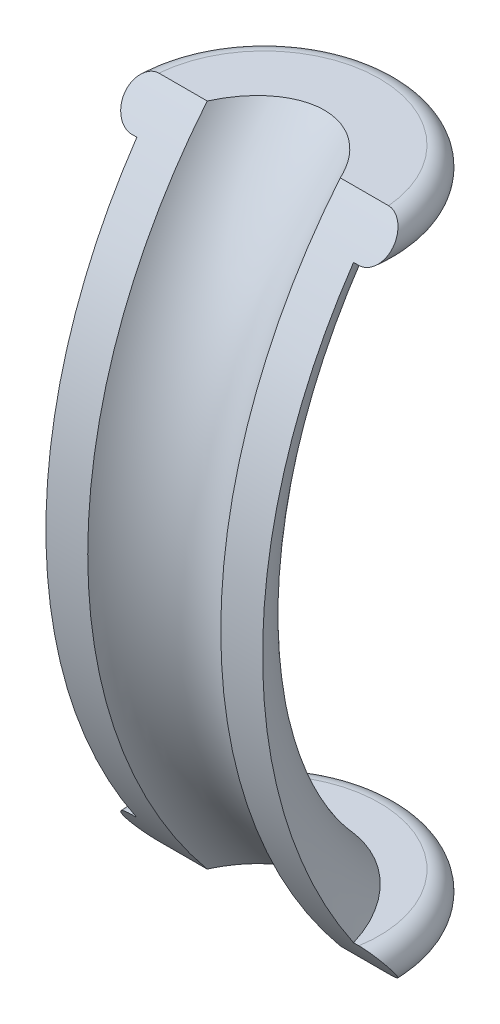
ISO-10303-21;
HEADER;
FILE_DESCRIPTION(('STEP AP214'),'2;1');
FILE_NAME('part.step','',(''),(''),'','','');
FILE_SCHEMA(('AUTOMOTIVE_DESIGN { 1 0 10303 214 1 1 1 1 }'));
ENDSEC;
DATA;
#1=APPLICATION_CONTEXT('core data for automotive mechanical design processes');
#2=APPLICATION_PROTOCOL_DEFINITION('international standard','automotive_design',2000,#1);
#3=PRODUCT_CONTEXT('',#1,'mechanical');
#4=PRODUCT('Part','Part','',(#3));
#5=PRODUCT_RELATED_PRODUCT_CATEGORY('part','',(#4));
#6=PRODUCT_DEFINITION_FORMATION('','',#4);
#7=PRODUCT_DEFINITION_CONTEXT('part definition',#1,'design');
#8=PRODUCT_DEFINITION('design','',#6,#7);
#9=PRODUCT_DEFINITION_SHAPE('','',#8);
#10=(LENGTH_UNIT() NAMED_UNIT(*) SI_UNIT(.MILLI.,.METRE.));
#11=(NAMED_UNIT(*) PLANE_ANGLE_UNIT() SI_UNIT($,.RADIAN.));
#12=(NAMED_UNIT(*) SI_UNIT($,.STERADIAN.) SOLID_ANGLE_UNIT());
#13=UNCERTAINTY_MEASURE_WITH_UNIT(LENGTH_MEASURE(1.E-05),#10,'distance_accuracy_value','');
#14=(GEOMETRIC_REPRESENTATION_CONTEXT(3) GLOBAL_UNCERTAINTY_ASSIGNED_CONTEXT((#13)) GLOBAL_UNIT_ASSIGNED_CONTEXT((#10,
#11,#12)) REPRESENTATION_CONTEXT('',''));
#15=CARTESIAN_POINT('',(0.,0.,0.));
#16=DIRECTION('',(0.,0.,1.));
#17=DIRECTION('',(1.,0.,0.));
#18=AXIS2_PLACEMENT_3D('',#15,#16,#17);
#19=CARTESIAN_POINT('',(0.,22.5,-133.));
#20=DIRECTION('',(1.,0.,0.));
#21=DIRECTION('',(0.,0.,-1.));
#22=AXIS2_PLACEMENT_3D('',#19,#20,#21);
#23=TOROIDAL_SURFACE('',#22,59.125,8.125);
#24=CARTESIAN_POINT('',(-6.99999999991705,22.5000000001,-133.0000000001));
#25=DIRECTION('',(1.,0.,0.));
#26=DIRECTION('',(0.,0.,-1.));
#27=AXIS2_PLACEMENT_3D('',#24,#25,#26);
#28=CIRCLE('',#27,55.);
#29=CARTESIAN_POINT('',(-6.99999999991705,-12.5,-90.5735931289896));
#30=VERTEX_POINT('',#29);
#31=CARTESIAN_POINT('',(-6.99999999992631,57.5000000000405,-90.5735931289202));
#32=VERTEX_POINT('',#31);
#33=EDGE_CURVE('E137',#30,#32,#28,.F.);
#34=ORIENTED_EDGE('',*,*,#33,.F.);
#35=CARTESIAN_POINT('',(0.,-12.5,-95.9055260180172));
#36=CARTESIAN_POINT('',(-0.0937331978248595,-12.5,-95.9055281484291));
#37=CARTESIAN_POINT('',(-0.187451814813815,-12.5,-95.9032952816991));
#38=CARTESIAN_POINT('',(-0.374672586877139,-12.5,-95.8943860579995));
#39=CARTESIAN_POINT('',(-0.46817475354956,-12.5,-95.8877099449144));
#40=CARTESIAN_POINT('',(-0.747888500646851,-12.5,-95.8610754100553));
#41=CARTESIAN_POINT('',(-0.933511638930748,-12.5,-95.8345106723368));
#42=CARTESIAN_POINT('',(-1.29984085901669,-12.5,-95.764673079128));
#43=CARTESIAN_POINT('',(-1.48057588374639,-12.5,-95.721549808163));
#44=CARTESIAN_POINT('',(-1.83754051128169,-12.5,-95.619483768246));
#45=CARTESIAN_POINT('',(-2.01376940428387,-12.5,-95.5605385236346));
#46=CARTESIAN_POINT('',(-2.36003599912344,-12.5,-95.428158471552));
#47=CARTESIAN_POINT('',(-2.53009158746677,-12.5,-95.3547702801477));
#48=CARTESIAN_POINT('',(-2.86373486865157,-12.5,-95.1946275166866));
#49=CARTESIAN_POINT('',(-3.02732277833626,-12.5,-95.1078733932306));
#50=CARTESIAN_POINT('',(-3.50815213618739,-12.5,-94.829018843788));
#51=CARTESIAN_POINT('',(-3.81484604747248,-12.5,-94.6185673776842));
#52=CARTESIAN_POINT('',(-4.51548035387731,-12.5,-94.0648010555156));
#53=CARTESIAN_POINT('',(-4.8942127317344,-12.5,-93.7022515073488));
#54=CARTESIAN_POINT('',(-5.41441773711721,-12.5,-93.1168288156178));
#55=CARTESIAN_POINT('',(-5.58000849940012,-12.5,-92.9144845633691));
#56=CARTESIAN_POINT('',(-5.89537787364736,-12.5,-92.4978329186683));
#57=CARTESIAN_POINT('',(-6.04516129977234,-12.5,-92.2835291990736));
#58=CARTESIAN_POINT('',(-6.34135226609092,-12.5,-91.8257293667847));
#59=CARTESIAN_POINT('',(-6.48633351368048,-12.5,-91.5813152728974));
#60=CARTESIAN_POINT('',(-6.7571571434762,-12.5,-91.0837714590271));
#61=CARTESIAN_POINT('',(-6.8830970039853,-12.5,-90.8306948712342));
#62=CARTESIAN_POINT('',(-6.99999999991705,-12.5,-90.5735931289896));
#63=B_SPLINE_CURVE_WITH_KNOTS('',3,(#35,#36,#37,#38,#39,#40,#41,#42,#43,#44,#45,#46,#47,#48,#49,
#50,#51,#52,#53,#54,#55,#56,#57,#58,#59,#60,#61,#62),.UNSPECIFIED.,.F.,.F.,(4,2,2,2,2,2,2,2,2,2,
2,2,2,4),(0.,0.281144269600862,0.562273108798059,1.12392034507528,1.68060886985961,
2.23738455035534,2.79239181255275,3.34738045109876,4.45931236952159,6.02320977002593,
6.80705887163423,7.59066855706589,8.44242246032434,9.289656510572),.UNSPECIFIED.);
#64=CARTESIAN_POINT('',(0.,-12.5,-95.9055260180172));
#65=VERTEX_POINT('',#64);
#66=EDGE_CURVE('E244',#65,#30,#63,.T.);
#67=ORIENTED_EDGE('',*,*,#66,.F.);
#68=CARTESIAN_POINT('',(6.99999999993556,-12.5,-90.5735931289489));
#69=CARTESIAN_POINT('',(6.92877591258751,-12.5,-90.7302670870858));
#70=CARTESIAN_POINT('',(6.8542047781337,-12.5,-90.8854008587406));
#71=CARTESIAN_POINT('',(6.69830519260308,-12.5,-91.1922641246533));
#72=CARTESIAN_POINT('',(6.61697567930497,-12.5,-91.343993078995));
#73=CARTESIAN_POINT('',(6.3623192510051,-12.5,-91.7943457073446));
#74=CARTESIAN_POINT('',(6.17871949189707,-12.5,-92.0872607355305));
#75=CARTESIAN_POINT('',(5.78174064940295,-12.5,-92.6571797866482));
#76=CARTESIAN_POINT('',(5.56804870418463,-12.5,-92.9339667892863));
#77=CARTESIAN_POINT('',(5.11266778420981,-12.5,-93.4628141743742));
#78=CARTESIAN_POINT('',(4.87102034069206,-12.5,-93.7149102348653));
#79=CARTESIAN_POINT('',(4.31336335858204,-12.5,-94.2317146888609));
#80=CARTESIAN_POINT('',(3.99179066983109,-12.5,-94.4905712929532));
#81=CARTESIAN_POINT('',(3.48260048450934,-12.5,-94.8377542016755));
#82=CARTESIAN_POINT('',(3.30868408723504,-12.5,-94.946496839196));
#83=CARTESIAN_POINT('',(2.95225178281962,-12.5,-95.1489286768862));
#84=CARTESIAN_POINT('',(2.76973743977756,-12.5,-95.2426206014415));
#85=CARTESIAN_POINT('',(2.4243964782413,-12.5,-95.4007062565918));
#86=CARTESIAN_POINT('',(2.2626117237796,-12.5,-95.4673818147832));
#87=CARTESIAN_POINT('',(1.93421327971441,-12.5,-95.5875097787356));
#88=CARTESIAN_POINT('',(1.76760053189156,-12.5,-95.6409647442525));
#89=CARTESIAN_POINT('',(1.43068821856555,-12.5,-95.7336901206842));
#90=CARTESIAN_POINT('',(1.26039345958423,-12.5,-95.7729779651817));
#91=CARTESIAN_POINT('',(0.917111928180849,-12.5,-95.8367100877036));
#92=CARTESIAN_POINT('',(0.744126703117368,-12.5,-95.8611625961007));
#93=CARTESIAN_POINT('',(0.475606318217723,-12.5,-95.8871399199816));
#94=CARTESIAN_POINT('',(0.380562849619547,-12.5,-95.8940338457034));
#95=CARTESIAN_POINT('',(0.190350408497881,-12.5,-95.9032260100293));
#96=CARTESIAN_POINT('',(0.0951816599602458,-12.5,-95.9055288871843));
#97=CARTESIAN_POINT('',(0.,-12.5,-95.9055260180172));
#98=B_SPLINE_CURVE_WITH_KNOTS('',3,(#68,#69,#70,#71,#72,#73,#74,#75,#76,#77,#78,#79,#80,#81,#82,
#83,#84,#85,#86,#87,#88,#89,#90,#91,#92,#93,#94,#95,#96,#97),.UNSPECIFIED.,.F.,.F.,(4,2,2,2,2,2,
2,2,2,2,2,2,2,2,4),(0.,0.516232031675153,1.0325453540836,2.06804018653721,3.11522800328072,
4.16087960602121,5.39413308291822,6.00888788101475,6.62353127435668,7.14796688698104,
7.67230087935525,8.19598742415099,8.71938317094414,9.0051638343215,9.29065561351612),.UNSPECIFIED.);
#99=CARTESIAN_POINT('',(6.99999999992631,-12.5000000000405,-90.5735931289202));
#100=VERTEX_POINT('',#99);
#101=EDGE_CURVE('E21',#100,#65,#98,.T.);
#102=ORIENTED_EDGE('',*,*,#101,.F.);
#103=CARTESIAN_POINT('',(6.99999999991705,22.4999999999,-133.0000000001));
#104=DIRECTION('',(-1.,0.,0.));
#105=DIRECTION('',(0.,0.,1.));
#106=AXIS2_PLACEMENT_3D('',#103,#104,#105);
#107=CIRCLE('',#106,55.);
#108=CARTESIAN_POINT('',(6.99999999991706,57.5,-90.5735931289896));
#109=VERTEX_POINT('',#108);
#110=EDGE_CURVE('E215',#109,#100,#107,.F.);
#111=ORIENTED_EDGE('',*,*,#110,.F.);
#112=CARTESIAN_POINT('',(0.,57.5,-95.9055260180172));
#113=CARTESIAN_POINT('',(0.0937331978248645,57.5,-95.9055281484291));
#114=CARTESIAN_POINT('',(0.187451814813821,57.5,-95.9032952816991));
#115=CARTESIAN_POINT('',(0.374672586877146,57.5,-95.8943860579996));
#116=CARTESIAN_POINT('',(0.468174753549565,57.5,-95.8877099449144));
#117=CARTESIAN_POINT('',(0.747888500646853,57.5,-95.8610754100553));
#118=CARTESIAN_POINT('',(0.933511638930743,57.5,-95.8345106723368));
#119=CARTESIAN_POINT('',(1.29984085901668,57.5,-95.764673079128));
#120=CARTESIAN_POINT('',(1.48057588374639,57.5,-95.721549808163));
#121=CARTESIAN_POINT('',(1.8375405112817,57.5,-95.619483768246));
#122=CARTESIAN_POINT('',(2.01376940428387,57.5,-95.5605385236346));
#123=CARTESIAN_POINT('',(2.36003599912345,57.5,-95.428158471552));
#124=CARTESIAN_POINT('',(2.53009158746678,57.5,-95.3547702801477));
#125=CARTESIAN_POINT('',(2.86373486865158,57.5,-95.1946275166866));
#126=CARTESIAN_POINT('',(3.02732277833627,57.5,-95.1078733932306));
#127=CARTESIAN_POINT('',(3.5081521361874,57.5,-94.829018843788));
#128=CARTESIAN_POINT('',(3.81484604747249,57.5,-94.6185673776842));
#129=CARTESIAN_POINT('',(4.51548035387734,57.5,-94.0648010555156));
#130=CARTESIAN_POINT('',(4.89421273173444,57.5,-93.7022515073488));
#131=CARTESIAN_POINT('',(5.41441773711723,57.5,-93.1168288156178));
#132=CARTESIAN_POINT('',(5.58000849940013,57.5,-92.9144845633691));
#133=CARTESIAN_POINT('',(5.89537787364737,57.5,-92.4978329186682));
#134=CARTESIAN_POINT('',(6.04516129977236,57.5,-92.2835291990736));
#135=CARTESIAN_POINT('',(6.34135226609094,57.5,-91.8257293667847));
#136=CARTESIAN_POINT('',(6.48633351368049,57.5,-91.5813152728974));
#137=CARTESIAN_POINT('',(6.75715714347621,57.5,-91.0837714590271));
#138=CARTESIAN_POINT('',(6.88309700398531,57.5,-90.8306948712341));
#139=CARTESIAN_POINT('',(6.99999999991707,57.5,-90.5735931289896));
#140=B_SPLINE_CURVE_WITH_KNOTS('',3,(#112,#113,#114,#115,#116,#117,#118,#119,#120,#121,#122,
#123,#124,#125,#126,#127,#128,#129,#130,#131,#132,#133,#134,#135,#136,#137,#138,#139),
.UNSPECIFIED.,.F.,.F.,(4,2,2,2,2,2,2,2,2,2,2,2,2,4),(0.,0.281144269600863,0.562273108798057,
1.12392034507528,1.68060886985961,2.23738455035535,2.79239181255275,3.34738045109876,
4.45931236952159,6.02320977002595,6.80705887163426,7.59066855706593,8.44242246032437,
9.28965651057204),.UNSPECIFIED.);
#141=CARTESIAN_POINT('',(0.,57.5,-95.9055260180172));
#142=VERTEX_POINT('',#141);
#143=EDGE_CURVE('E123',#142,#109,#140,.T.);
#144=ORIENTED_EDGE('',*,*,#143,.F.);
#145=CARTESIAN_POINT('',(-6.99999999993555,57.5,-90.5735931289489));
#146=CARTESIAN_POINT('',(-6.92877591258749,57.5,-90.7302670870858));
#147=CARTESIAN_POINT('',(-6.85420477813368,57.5,-90.8854008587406));
#148=CARTESIAN_POINT('',(-6.69830519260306,57.5,-91.1922641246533));
#149=CARTESIAN_POINT('',(-6.61697567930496,57.5,-91.3439930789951));
#150=CARTESIAN_POINT('',(-6.36231925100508,57.5,-91.7943457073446));
#151=CARTESIAN_POINT('',(-6.17871949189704,57.5,-92.0872607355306));
#152=CARTESIAN_POINT('',(-5.78174064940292,57.5,-92.6571797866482));
#153=CARTESIAN_POINT('',(-5.56804870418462,57.5,-92.9339667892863));
#154=CARTESIAN_POINT('',(-5.1126677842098,57.5,-93.4628141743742));
#155=CARTESIAN_POINT('',(-4.87102034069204,57.5,-93.7149102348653));
#156=CARTESIAN_POINT('',(-4.313363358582,57.5,-94.2317146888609));
#157=CARTESIAN_POINT('',(-3.99179066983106,57.5,-94.4905712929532));
#158=CARTESIAN_POINT('',(-3.4826004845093,57.5,-94.8377542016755));
#159=CARTESIAN_POINT('',(-3.30868408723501,57.5,-94.946496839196));
#160=CARTESIAN_POINT('',(-2.95225178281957,57.5,-95.1489286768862));
#161=CARTESIAN_POINT('',(-2.76973743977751,57.5,-95.2426206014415));
#162=CARTESIAN_POINT('',(-2.42439647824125,57.5,-95.4007062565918));
#163=CARTESIAN_POINT('',(-2.26261172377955,57.5,-95.4673818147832));
#164=CARTESIAN_POINT('',(-1.93421327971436,57.5,-95.5875097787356));
#165=CARTESIAN_POINT('',(-1.76760053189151,57.5,-95.6409647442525));
#166=CARTESIAN_POINT('',(-1.43068821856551,57.5,-95.7336901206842));
#167=CARTESIAN_POINT('',(-1.26039345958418,57.5,-95.7729779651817));
#168=CARTESIAN_POINT('',(-0.9171119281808,57.5,-95.8367100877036));
#169=CARTESIAN_POINT('',(-0.744126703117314,57.5,-95.8611625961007));
#170=CARTESIAN_POINT('',(-0.475606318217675,57.5,-95.8871399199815));
#171=CARTESIAN_POINT('',(-0.380562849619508,57.5,-95.8940338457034));
#172=CARTESIAN_POINT('',(-0.19035040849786,57.5,-95.9032260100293));
#173=CARTESIAN_POINT('',(-0.095181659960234,57.5,-95.9055288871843));
#174=CARTESIAN_POINT('',(0.,57.5,-95.9055260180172));
#175=B_SPLINE_CURVE_WITH_KNOTS('',3,(#145,#146,#147,#148,#149,#150,#151,#152,#153,#154,#155,
#156,#157,#158,#159,#160,#161,#162,#163,#164,#165,#166,#167,#168,#169,#170,#171,#172,#173,#174),
.UNSPECIFIED.,.F.,.F.,(4,2,2,2,2,2,2,2,2,2,2,2,2,2,4),(0.,0.516232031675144,1.0325453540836,
2.0680401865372,3.1152280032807,4.1608796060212,5.39413308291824,6.00888788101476,
6.62353127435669,7.14796688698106,7.67230087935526,8.19598742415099,8.71938317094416,
9.00516383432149,9.29065561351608),.UNSPECIFIED.);
#176=EDGE_CURVE('E358',#32,#142,#175,.T.);
#177=ORIENTED_EDGE('',*,*,#176,.F.);
#178=EDGE_LOOP('',(#34,#67,#102,#111,#144,#177));
#179=FACE_BOUND('',#178,.T.);
#180=ADVANCED_FACE('F16',(#179),#23,.F.);
#181=CARTESIAN_POINT('',(0.,-12.5,-98.));
#182=DIRECTION('',(0.,-1.,0.));
#183=DIRECTION('',(0.,0.,-1.));
#184=AXIS2_PLACEMENT_3D('',#181,#182,#183);
#185=PLANE('',#184);
#186=CARTESIAN_POINT('',(0.,-12.5,-89.55935832));
#187=DIRECTION('',(0.,1.,0.));
#188=DIRECTION('',(0.996495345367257,0.,-0.0836482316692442));
#189=AXIS2_PLACEMENT_3D('',#186,#187,#188);
#190=CIRCLE('',#189,12.125);
#191=CARTESIAN_POINT('',(12.082506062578,-12.5000000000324,-90.5735931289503));
#192=VERTEX_POINT('',#191);
#193=CARTESIAN_POINT('',(-12.082506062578,-12.5,-90.5735931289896));
#194=VERTEX_POINT('',#193);
#195=EDGE_CURVE('E99',#192,#194,#190,.T.);
#196=ORIENTED_EDGE('',*,*,#195,.F.);
#197=DIRECTION('',(-1.,0.,0.));
#198=VECTOR('',#197,1.);
#199=CARTESIAN_POINT('',(-15.,-12.500000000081,-90.5735931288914));
#200=LINE('',#199,#198);
#201=EDGE_CURVE('E328',#100,#192,#200,.F.);
#202=ORIENTED_EDGE('',*,*,#201,.F.);
#203=ORIENTED_EDGE('',*,*,#101,.T.);
#204=ORIENTED_EDGE('',*,*,#66,.T.);
#205=DIRECTION('',(1.,0.,0.));
#206=VECTOR('',#205,1.);
#207=CARTESIAN_POINT('',(15.,-12.5,-90.5735931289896));
#208=LINE('',#207,#206);
#209=EDGE_CURVE('E243',#194,#30,#208,.T.);
#210=ORIENTED_EDGE('',*,*,#209,.F.);
#211=EDGE_LOOP('',(#196,#202,#203,#204,#210));
#212=FACE_BOUND('',#211,.T.);
#213=ADVANCED_FACE('F209',(#212),#185,.T.);
#214=CARTESIAN_POINT('',(0.,55.5,-89.55935832));
#215=DIRECTION('',(0.,-1.,0.));
#216=DIRECTION('',(0.,0.,-1.));
#217=AXIS2_PLACEMENT_3D('',#214,#215,#216);
#218=TOROIDAL_SURFACE('',#217,12.125,2.);
#219=CARTESIAN_POINT('',(0.,53.5,-89.55935832));
#220=DIRECTION('',(0.,1.,0.));
#221=DIRECTION('',(0.986431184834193,0.,0.164175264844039));
#222=AXIS2_PLACEMENT_3D('',#219,#220,#221);
#223=CIRCLE('',#222,12.125);
#224=CARTESIAN_POINT('',(-11.9604781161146,53.5000000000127,-87.5687332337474));
#225=VERTEX_POINT('',#224);
#226=CARTESIAN_POINT('',(11.9604781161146,53.5,-87.568733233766));
#227=VERTEX_POINT('',#226);
#228=EDGE_CURVE('E229',#225,#227,#223,.F.);
#229=ORIENTED_EDGE('',*,*,#228,.F.);
#230=CARTESIAN_POINT('',(-14.1139201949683,55.5000000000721,-89.000000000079));
#231=CARTESIAN_POINT('',(-14.111891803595,55.4320309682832,-88.9490218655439));
#232=CARTESIAN_POINT('',(-14.1061423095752,55.3640496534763,-88.8982837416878));
#233=CARTESIAN_POINT('',(-14.0871716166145,55.2285028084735,-88.7975993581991));
#234=CARTESIAN_POINT('',(-14.0739473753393,55.1609374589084,-88.7476534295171));
#235=CARTESIAN_POINT('',(-14.0229345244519,54.9592510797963,-88.5992703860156));
#236=CARTESIAN_POINT('',(-13.9738162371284,54.8265082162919,-88.5025642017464));
#237=CARTESIAN_POINT('',(-13.8499093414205,54.5780368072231,-88.3231420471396));
#238=CARTESIAN_POINT('',(-13.7769239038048,54.4617633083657,-88.2399290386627));
#239=CARTESIAN_POINT('',(-13.605828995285,54.2417025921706,-88.0836056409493));
#240=CARTESIAN_POINT('',(-13.5077573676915,54.1378969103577,-88.0104802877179));
#241=CARTESIAN_POINT('',(-13.2980176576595,53.9564402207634,-87.8834448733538));
#242=CARTESIAN_POINT('',(-13.1883770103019,53.8772738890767,-87.8283959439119));
#243=CARTESIAN_POINT('',(-13.0114077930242,53.7729479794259,-87.7561658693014));
#244=CARTESIAN_POINT('',(-12.9503257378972,53.7405737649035,-87.7338111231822));
#245=CARTESIAN_POINT('',(-12.8244107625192,53.6811998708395,-87.6928916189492));
#246=CARTESIAN_POINT('',(-12.7595795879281,53.6541977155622,-87.674325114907));
#247=CARTESIAN_POINT('',(-12.5989507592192,53.5961403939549,-87.6344649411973));
#248=CARTESIAN_POINT('',(-12.5015152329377,53.5680918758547,-87.6152635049));
#249=CARTESIAN_POINT('',(-12.3025268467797,53.5257692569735,-87.5863201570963));
#250=CARTESIAN_POINT('',(-12.2009876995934,53.5114526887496,-87.5765490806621));
#251=CARTESIAN_POINT('',(-12.0758331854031,53.5030919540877,-87.5708432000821));
#252=CARTESIAN_POINT('',(-12.0527776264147,53.5019346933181,-87.5700534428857));
#253=CARTESIAN_POINT('',(-12.0066433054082,53.5003894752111,-87.5689989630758));
#254=CARTESIAN_POINT('',(-11.9835645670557,53.5000010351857,-87.5687339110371));
#255=CARTESIAN_POINT('',(-11.9604781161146,53.5,-87.5687332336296));
#256=B_SPLINE_CURVE_WITH_KNOTS('',3,(#230,#231,#232,#233,#234,#235,#236,#237,#238,#239,#240,
#241,#242,#243,#244,#245,#246,#247,#248,#249,#250,#251,#252,#253,#254,#255),.UNSPECIFIED.,.F.,
.F.,(4,2,2,2,2,2,2,2,2,2,2,2,4),(0.,0.254782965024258,0.509669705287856,1.02080567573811,
1.49988469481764,1.9782452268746,2.41340995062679,2.63104149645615,2.84857251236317,
3.15683016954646,3.46413140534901,3.53341430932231,3.60265370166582),.UNSPECIFIED.);
#257=CARTESIAN_POINT('',(-14.1139201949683,55.5000000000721,-89.000000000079));
#258=VERTEX_POINT('',#257);
#259=EDGE_CURVE('E131',#258,#225,#256,.T.);
#260=ORIENTED_EDGE('',*,*,#259,.F.);
#261=CARTESIAN_POINT('',(-12.082506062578,57.5,-90.5735931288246));
#262=CARTESIAN_POINT('',(-12.1316159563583,57.500009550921,-90.5736017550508));
#263=CARTESIAN_POINT('',(-12.1807117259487,57.4982041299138,-90.5721116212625));
#264=CARTESIAN_POINT('',(-12.2784368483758,57.4910950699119,-90.5662480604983));
#265=CARTESIAN_POINT('',(-12.3270665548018,57.4857943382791,-90.5618770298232));
#266=CARTESIAN_POINT('',(-12.4231747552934,57.4718737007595,-90.5504048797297));
#267=CARTESIAN_POINT('',(-12.4706588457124,57.4632767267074,-90.5433226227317));
#268=CARTESIAN_POINT('',(-12.5644824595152,57.442945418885,-90.5265878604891));
#269=CARTESIAN_POINT('',(-12.6108217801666,57.4312105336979,-90.5169349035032));
#270=CARTESIAN_POINT('',(-12.7473812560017,57.3916760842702,-90.4844486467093));
#271=CARTESIAN_POINT('',(-12.835534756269,57.3594875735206,-90.4580390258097));
#272=CARTESIAN_POINT('',(-13.0045747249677,57.2850709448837,-90.3971697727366));
#273=CARTESIAN_POINT('',(-13.0854479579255,57.2428250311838,-90.3626958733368));
#274=CARTESIAN_POINT('',(-13.2466136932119,57.1452199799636,-90.2833396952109));
#275=CARTESIAN_POINT('',(-13.3260170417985,57.0889658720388,-90.2377567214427));
#276=CARTESIAN_POINT('',(-13.4738800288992,56.9682098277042,-90.1403624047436));
#277=CARTESIAN_POINT('',(-13.5423384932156,56.9037070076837,-90.0885503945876));
#278=CARTESIAN_POINT('',(-13.6798782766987,56.7551640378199,-89.9698433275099));
#279=CARTESIAN_POINT('',(-13.7466080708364,56.6697400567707,-89.9019526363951));
#280=CARTESIAN_POINT('',(-13.8637093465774,56.4917718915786,-89.7614485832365));
#281=CARTESIAN_POINT('',(-13.914062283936,56.3992197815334,-89.6888299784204));
#282=CARTESIAN_POINT('',(-14.0047418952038,56.1941618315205,-89.5290571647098));
#283=CARTESIAN_POINT('',(-14.0422652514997,56.080800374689,-89.4414070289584));
#284=CARTESIAN_POINT('',(-14.0948297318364,55.8503084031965,-89.2646832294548));
#285=CARTESIAN_POINT('',(-14.1099059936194,55.7331840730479,-89.1756120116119));
#286=CARTESIAN_POINT('',(-14.1150118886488,55.5770839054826,-89.0578914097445));
#287=CARTESIAN_POINT('',(-14.1150681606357,55.5385419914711,-89.0289052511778));
#288=CARTESIAN_POINT('',(-14.1139201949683,55.5000000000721,-89.000000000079));
#289=B_SPLINE_CURVE_WITH_KNOTS('',3,(#261,#262,#263,#264,#265,#266,#267,#268,#269,#270,#271,
#272,#273,#274,#275,#276,#277,#278,#279,#280,#281,#282,#283,#284,#285,#286,#287,#288),
.UNSPECIFIED.,.F.,.F.,(4,2,2,2,2,2,2,2,2,2,2,2,2,4),(0.,0.147252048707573,0.294381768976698,
0.440505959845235,0.586655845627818,0.87777299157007,1.16940912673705,1.49059538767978,
1.81181608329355,2.19404994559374,2.57671513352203,3.01928152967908,3.46115441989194,
3.60576443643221),.UNSPECIFIED.);
#290=CARTESIAN_POINT('',(-12.082506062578,57.5000000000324,-90.5735931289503));
#291=VERTEX_POINT('',#290);
#292=EDGE_CURVE('E127',#291,#258,#289,.T.);
#293=ORIENTED_EDGE('',*,*,#292,.F.);
#294=CARTESIAN_POINT('',(0.,57.5,-89.55935832));
#295=DIRECTION('',(0.,-1.,0.));
#296=DIRECTION('',(-0.996495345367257,0.,-0.0836482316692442));
#297=AXIS2_PLACEMENT_3D('',#294,#295,#296);
#298=CIRCLE('',#297,12.125);
#299=CARTESIAN_POINT('',(12.082506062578,57.5,-90.5735931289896));
#300=VERTEX_POINT('',#299);
#301=EDGE_CURVE('E109',#300,#291,#298,.F.);
#302=ORIENTED_EDGE('',*,*,#301,.F.);
#303=CARTESIAN_POINT('',(14.1139201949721,55.5,-89.000000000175));
#304=CARTESIAN_POINT('',(14.1179863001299,55.6357106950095,-89.1017381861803));
#305=CARTESIAN_POINT('',(14.1070939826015,55.771288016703,-89.2044453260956));
#306=CARTESIAN_POINT('',(14.0555147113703,56.0386432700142,-89.4088676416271));
#307=CARTESIAN_POINT('',(14.0146616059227,56.1703957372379,-89.5105740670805));
#308=CARTESIAN_POINT('',(13.9061487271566,56.4183160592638,-89.7036778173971));
#309=CARTESIAN_POINT('',(13.839998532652,56.5349383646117,-89.7953361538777));
#310=CARTESIAN_POINT('',(13.6815327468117,56.7557596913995,-89.9702127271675));
#311=CARTESIAN_POINT('',(13.5892934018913,56.8599936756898,-90.0534546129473));
#312=CARTESIAN_POINT('',(13.4082133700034,57.025194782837,-90.1862290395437));
#313=CARTESIAN_POINT('',(13.3252578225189,57.090223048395,-90.2387755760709));
#314=CARTESIAN_POINT('',(13.1467868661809,57.2087696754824,-90.3349427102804));
#315=CARTESIAN_POINT('',(13.0512808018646,57.2622965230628,-90.378569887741));
#316=CARTESIAN_POINT('',(12.8657347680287,57.3475163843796,-90.4482299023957));
#317=CARTESIAN_POINT('',(12.7773149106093,57.3813415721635,-90.4759679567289));
#318=CARTESIAN_POINT('',(12.5945206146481,57.4371336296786,-90.5217937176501));
#319=CARTESIAN_POINT('',(12.5001602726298,57.4591274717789,-90.5399033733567));
#320=CARTESIAN_POINT('',(12.3512306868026,57.4828503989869,-90.5594498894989));
#321=CARTESIAN_POINT('',(12.2978585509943,57.4892448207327,-90.5647222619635));
#322=CARTESIAN_POINT('',(12.1905076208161,57.4978254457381,-90.5717991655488));
#323=CARTESIAN_POINT('',(12.1365283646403,57.5000081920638,-90.5736008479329));
#324=CARTESIAN_POINT('',(12.082506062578,57.5,-90.5735931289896));
#325=B_SPLINE_CURVE_WITH_KNOTS('',3,(#303,#304,#305,#306,#307,#308,#309,#310,#311,#312,#313,
#314,#315,#316,#317,#318,#319,#320,#321,#322,#323,#324),.UNSPECIFIED.,.F.,.F.,(4,2,2,2,2,2,2,2,
2,2,4),(0.,0.508545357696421,1.01993245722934,1.50464238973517,1.98795012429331,
2.33994972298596,2.69168870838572,2.98645759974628,3.28055161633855,3.4423350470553,
3.60425121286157),.UNSPECIFIED.);
#326=CARTESIAN_POINT('',(14.1139201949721,55.5,-89.000000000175));
#327=VERTEX_POINT('',#326);
#328=EDGE_CURVE('E340',#327,#300,#325,.T.);
#329=ORIENTED_EDGE('',*,*,#328,.F.);
#330=CARTESIAN_POINT('',(11.9604781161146,53.5,-87.568733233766));
#331=CARTESIAN_POINT('',(12.0136786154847,53.4999922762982,-87.5687287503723));
#332=CARTESIAN_POINT('',(12.066861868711,53.5020651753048,-87.5701424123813));
#333=CARTESIAN_POINT('',(12.1727392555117,53.5102014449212,-87.5756953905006));
#334=CARTESIAN_POINT('',(12.2254337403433,53.5162616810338,-87.5798325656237));
#335=CARTESIAN_POINT('',(12.3296624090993,53.5321564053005,-87.5906908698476));
#336=CARTESIAN_POINT('',(12.3812015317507,53.541968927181,-87.597396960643));
#337=CARTESIAN_POINT('',(12.4830805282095,53.565158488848,-87.6132604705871));
#338=CARTESIAN_POINT('',(12.5334201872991,53.5785361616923,-87.6224183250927));
#339=CARTESIAN_POINT('',(12.6818615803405,53.6235995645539,-87.6533035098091));
#340=CARTESIAN_POINT('',(12.7777896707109,53.6602798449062,-87.6784861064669));
#341=CARTESIAN_POINT('',(12.9618320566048,53.7451192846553,-87.7369337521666));
#342=CARTESIAN_POINT('',(13.0499341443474,53.7932959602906,-87.7702111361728));
#343=CARTESIAN_POINT('',(13.2252930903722,53.9045870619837,-87.847403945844));
#344=CARTESIAN_POINT('',(13.3115856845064,53.9687131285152,-87.8920501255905));
#345=CARTESIAN_POINT('',(13.4718233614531,54.1063131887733,-87.9883568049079));
#346=CARTESIAN_POINT('',(13.5457677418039,54.1797877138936,-88.0400177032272));
#347=CARTESIAN_POINT('',(13.6903512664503,54.3452060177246,-88.1570015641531));
#348=CARTESIAN_POINT('',(13.7589691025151,54.438284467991,-88.223220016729));
#349=CARTESIAN_POINT('',(13.8784729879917,54.6313152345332,-88.3615329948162));
#350=CARTESIAN_POINT('',(13.9293394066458,54.7312750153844,-88.4336339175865));
#351=CARTESIAN_POINT('',(14.0153685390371,54.9415178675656,-88.5864250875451));
#352=CARTESIAN_POINT('',(14.0494346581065,55.052062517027,-88.6673710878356));
#353=CARTESIAN_POINT('',(14.0970352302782,55.2751430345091,-88.8320288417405));
#354=CARTESIAN_POINT('',(14.1106111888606,55.3876744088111,-88.915734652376));
#355=CARTESIAN_POINT('',(14.1139201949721,55.5,-89.000000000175));
#356=B_SPLINE_CURVE_WITH_KNOTS('',3,(#330,#331,#332,#333,#334,#335,#336,#337,#338,#339,#340,
#341,#342,#343,#344,#345,#346,#347,#348,#349,#350,#351,#352,#353,#354,#355),.UNSPECIFIED.,.F.,
.F.,(4,2,2,2,2,2,2,2,2,2,2,2,4),(0.,0.159516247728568,0.318907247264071,0.477379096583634,
0.635879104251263,0.951660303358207,1.26792574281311,1.61579580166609,1.96368564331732,
2.36184168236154,2.76043664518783,3.18242025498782,3.60354792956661),.UNSPECIFIED.);
#357=EDGE_CURVE('E335',#227,#327,#356,.T.);
#358=ORIENTED_EDGE('',*,*,#357,.F.);
#359=EDGE_LOOP('',(#229,#260,#293,#302,#329,#358));
#360=FACE_BOUND('',#359,.T.);
#361=ADVANCED_FACE('F129',(#360),#218,.T.);
#362=CARTESIAN_POINT('',(0.,57.5,-98.));
#363=DIRECTION('',(0.,1.,0.));
#364=DIRECTION('',(0.,0.,1.));
#365=AXIS2_PLACEMENT_3D('',#362,#363,#364);
#366=PLANE('',#365);
#367=ORIENTED_EDGE('',*,*,#301,.T.);
#368=DIRECTION('',(1.,0.,0.));
#369=VECTOR('',#368,1.);
#370=CARTESIAN_POINT('',(15.,57.500000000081,-90.5735931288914));
#371=LINE('',#370,#369);
#372=EDGE_CURVE('E115',#32,#291,#371,.F.);
#373=ORIENTED_EDGE('',*,*,#372,.F.);
#374=ORIENTED_EDGE('',*,*,#176,.T.);
#375=ORIENTED_EDGE('',*,*,#143,.T.);
#376=DIRECTION('',(-1.,0.,0.));
#377=VECTOR('',#376,1.);
#378=CARTESIAN_POINT('',(-15.,57.5,-90.5735931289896));
#379=LINE('',#378,#377);
#380=EDGE_CURVE('E119',#300,#109,#379,.T.);
#381=ORIENTED_EDGE('',*,*,#380,.F.);
#382=EDGE_LOOP('',(#367,#373,#374,#375,#381));
#383=FACE_BOUND('',#382,.T.);
#384=ADVANCED_FACE('F112',(#383),#366,.T.);
#385=CARTESIAN_POINT('',(0.,-10.5,-89.55935832));
#386=DIRECTION('',(0.,1.,0.));
#387=DIRECTION('',(0.,0.,1.));
#388=AXIS2_PLACEMENT_3D('',#385,#386,#387);
#389=TOROIDAL_SURFACE('',#388,12.125,2.);
#390=CARTESIAN_POINT('',(0.,-8.5,-89.55935832));
#391=DIRECTION('',(0.,-1.,0.));
#392=DIRECTION('',(-0.986431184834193,0.,0.164175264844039));
#393=AXIS2_PLACEMENT_3D('',#390,#391,#392);
#394=CIRCLE('',#393,12.125);
#395=CARTESIAN_POINT('',(11.9604781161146,-8.50000000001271,-87.5687332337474));
#396=VERTEX_POINT('',#395);
#397=CARTESIAN_POINT('',(-11.9604781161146,-8.49999999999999,-87.568733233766));
#398=VERTEX_POINT('',#397);
#399=EDGE_CURVE('E251',#396,#398,#394,.F.);
#400=ORIENTED_EDGE('',*,*,#399,.F.);
#401=CARTESIAN_POINT('',(14.1139201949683,-10.5000000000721,-89.0000000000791));
#402=CARTESIAN_POINT('',(14.111891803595,-10.4320309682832,-88.949021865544));
#403=CARTESIAN_POINT('',(14.1061423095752,-10.3640496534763,-88.8982837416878));
#404=CARTESIAN_POINT('',(14.0871716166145,-10.2285028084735,-88.7975993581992));
#405=CARTESIAN_POINT('',(14.0739473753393,-10.1609374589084,-88.7476534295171));
#406=CARTESIAN_POINT('',(14.0229345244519,-9.95925107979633,-88.5992703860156));
#407=CARTESIAN_POINT('',(13.9738162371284,-9.82650821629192,-88.5025642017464));
#408=CARTESIAN_POINT('',(13.8499093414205,-9.57803680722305,-88.3231420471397));
#409=CARTESIAN_POINT('',(13.7769239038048,-9.46176330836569,-88.2399290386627));
#410=CARTESIAN_POINT('',(13.605828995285,-9.24170259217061,-88.0836056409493));
#411=CARTESIAN_POINT('',(13.5077573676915,-9.13789691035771,-88.0104802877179));
#412=CARTESIAN_POINT('',(13.2980176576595,-8.95644022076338,-87.8834448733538));
#413=CARTESIAN_POINT('',(13.1883770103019,-8.87727388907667,-87.8283959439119));
#414=CARTESIAN_POINT('',(13.0114077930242,-8.77294797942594,-87.7561658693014));
#415=CARTESIAN_POINT('',(12.9503257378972,-8.74057376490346,-87.7338111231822));
#416=CARTESIAN_POINT('',(12.8244107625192,-8.68119987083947,-87.6928916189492));
#417=CARTESIAN_POINT('',(12.7595795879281,-8.65419771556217,-87.674325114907));
#418=CARTESIAN_POINT('',(12.5989507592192,-8.59614039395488,-87.6344649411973));
#419=CARTESIAN_POINT('',(12.5015152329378,-8.56809187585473,-87.6152635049));
#420=CARTESIAN_POINT('',(12.3025268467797,-8.52576925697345,-87.5863201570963));
#421=CARTESIAN_POINT('',(12.2009876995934,-8.51145268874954,-87.5765490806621));
#422=CARTESIAN_POINT('',(12.0758331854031,-8.50309195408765,-87.5708432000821));
#423=CARTESIAN_POINT('',(12.0527776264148,-8.50193469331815,-87.5700534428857));
#424=CARTESIAN_POINT('',(12.0066433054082,-8.50038947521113,-87.5689989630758));
#425=CARTESIAN_POINT('',(11.9835645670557,-8.50000103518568,-87.5687339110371));
#426=CARTESIAN_POINT('',(11.9604781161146,-8.5,-87.5687332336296));
#427=B_SPLINE_CURVE_WITH_KNOTS('',3,(#401,#402,#403,#404,#405,#406,#407,#408,#409,#410,#411,
#412,#413,#414,#415,#416,#417,#418,#419,#420,#421,#422,#423,#424,#425,#426),.UNSPECIFIED.,.F.,
.F.,(4,2,2,2,2,2,2,2,2,2,2,2,4),(0.,0.254782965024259,0.509669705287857,1.0208056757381,
1.49988469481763,1.97824522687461,2.4134099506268,2.63104149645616,2.84857251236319,
3.15683016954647,3.46413140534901,3.53341430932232,3.60265370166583),.UNSPECIFIED.);
#428=CARTESIAN_POINT('',(14.1139201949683,-10.5000000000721,-89.0000000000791));
#429=VERTEX_POINT('',#428);
#430=EDGE_CURVE('E336',#429,#396,#427,.T.);
#431=ORIENTED_EDGE('',*,*,#430,.F.);
#432=CARTESIAN_POINT('',(12.082506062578,-12.5,-90.5735931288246));
#433=CARTESIAN_POINT('',(12.1316159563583,-12.500009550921,-90.5736017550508));
#434=CARTESIAN_POINT('',(12.1807117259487,-12.4982041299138,-90.5721116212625));
#435=CARTESIAN_POINT('',(12.2784368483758,-12.4910950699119,-90.5662480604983));
#436=CARTESIAN_POINT('',(12.3270665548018,-12.4857943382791,-90.5618770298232));
#437=CARTESIAN_POINT('',(12.4231747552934,-12.4718737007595,-90.5504048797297));
#438=CARTESIAN_POINT('',(12.4706588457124,-12.4632767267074,-90.5433226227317));
#439=CARTESIAN_POINT('',(12.5644824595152,-12.442945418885,-90.526587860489));
#440=CARTESIAN_POINT('',(12.6108217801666,-12.4312105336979,-90.5169349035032));
#441=CARTESIAN_POINT('',(12.7473812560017,-12.3916760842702,-90.4844486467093));
#442=CARTESIAN_POINT('',(12.835534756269,-12.3594875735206,-90.4580390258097));
#443=CARTESIAN_POINT('',(13.0045747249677,-12.2850709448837,-90.3971697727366));
#444=CARTESIAN_POINT('',(13.0854479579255,-12.2428250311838,-90.3626958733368));
#445=CARTESIAN_POINT('',(13.2466136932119,-12.1452199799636,-90.2833396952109));
#446=CARTESIAN_POINT('',(13.3260170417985,-12.0889658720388,-90.2377567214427));
#447=CARTESIAN_POINT('',(13.4738800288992,-11.9682098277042,-90.1403624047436));
#448=CARTESIAN_POINT('',(13.5423384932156,-11.9037070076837,-90.0885503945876));
#449=CARTESIAN_POINT('',(13.6798782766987,-11.7551640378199,-89.9698433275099));
#450=CARTESIAN_POINT('',(13.7466080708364,-11.6697400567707,-89.9019526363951));
#451=CARTESIAN_POINT('',(13.8637093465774,-11.4917718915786,-89.7614485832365));
#452=CARTESIAN_POINT('',(13.914062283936,-11.3992197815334,-89.6888299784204));
#453=CARTESIAN_POINT('',(14.0047418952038,-11.1941618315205,-89.5290571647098));
#454=CARTESIAN_POINT('',(14.0422652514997,-11.080800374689,-89.4414070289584));
#455=CARTESIAN_POINT('',(14.0948297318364,-10.8503084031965,-89.2646832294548));
#456=CARTESIAN_POINT('',(14.1099059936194,-10.7331840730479,-89.1756120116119));
#457=CARTESIAN_POINT('',(14.1150118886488,-10.5770839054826,-89.0578914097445));
#458=CARTESIAN_POINT('',(14.1150681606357,-10.5385419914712,-89.0289052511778));
#459=CARTESIAN_POINT('',(14.1139201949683,-10.5000000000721,-89.000000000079));
#460=B_SPLINE_CURVE_WITH_KNOTS('',3,(#432,#433,#434,#435,#436,#437,#438,#439,#440,#441,#442,
#443,#444,#445,#446,#447,#448,#449,#450,#451,#452,#453,#454,#455,#456,#457,#458,#459),
.UNSPECIFIED.,.F.,.F.,(4,2,2,2,2,2,2,2,2,2,2,2,2,4),(0.,0.147252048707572,0.294381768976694,
0.440505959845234,0.586655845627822,0.87777299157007,1.16940912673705,1.49059538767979,
1.81181608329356,2.19404994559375,2.57671513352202,3.01928152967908,3.46115441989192,
3.6057644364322),.UNSPECIFIED.);
#461=EDGE_CURVE('E240',#192,#429,#460,.T.);
#462=ORIENTED_EDGE('',*,*,#461,.F.);
#463=ORIENTED_EDGE('',*,*,#195,.T.);
#464=CARTESIAN_POINT('',(-14.1139201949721,-10.5,-89.000000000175));
#465=CARTESIAN_POINT('',(-14.1179863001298,-10.6357106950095,-89.1017381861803));
#466=CARTESIAN_POINT('',(-14.1070939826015,-10.771288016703,-89.2044453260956));
#467=CARTESIAN_POINT('',(-14.0555147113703,-11.0386432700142,-89.4088676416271));
#468=CARTESIAN_POINT('',(-14.0146616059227,-11.1703957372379,-89.5105740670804));
#469=CARTESIAN_POINT('',(-13.9061487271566,-11.4183160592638,-89.7036778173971));
#470=CARTESIAN_POINT('',(-13.839998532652,-11.5349383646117,-89.7953361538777));
#471=CARTESIAN_POINT('',(-13.6815327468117,-11.7557596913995,-89.9702127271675));
#472=CARTESIAN_POINT('',(-13.5892934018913,-11.8599936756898,-90.0534546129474));
#473=CARTESIAN_POINT('',(-13.4082133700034,-12.0251947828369,-90.1862290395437));
#474=CARTESIAN_POINT('',(-13.3252578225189,-12.090223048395,-90.2387755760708));
#475=CARTESIAN_POINT('',(-13.1467868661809,-12.2087696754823,-90.3349427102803));
#476=CARTESIAN_POINT('',(-13.0512808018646,-12.2622965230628,-90.378569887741));
#477=CARTESIAN_POINT('',(-12.8657347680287,-12.3475163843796,-90.4482299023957));
#478=CARTESIAN_POINT('',(-12.7773149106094,-12.3813415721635,-90.4759679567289));
#479=CARTESIAN_POINT('',(-12.5945206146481,-12.4371336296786,-90.5217937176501));
#480=CARTESIAN_POINT('',(-12.5001602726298,-12.4591274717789,-90.5399033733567));
#481=CARTESIAN_POINT('',(-12.3512306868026,-12.4828503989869,-90.5594498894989));
#482=CARTESIAN_POINT('',(-12.2978585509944,-12.4892448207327,-90.5647222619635));
#483=CARTESIAN_POINT('',(-12.1905076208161,-12.4978254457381,-90.5717991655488));
#484=CARTESIAN_POINT('',(-12.1365283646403,-12.5000081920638,-90.5736008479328));
#485=CARTESIAN_POINT('',(-12.082506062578,-12.5,-90.5735931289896));
#486=B_SPLINE_CURVE_WITH_KNOTS('',3,(#464,#465,#466,#467,#468,#469,#470,#471,#472,#473,#474,
#475,#476,#477,#478,#479,#480,#481,#482,#483,#484,#485),.UNSPECIFIED.,.F.,.F.,(4,2,2,2,2,2,2,2,
2,2,4),(0.,0.508545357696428,1.01993245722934,1.50464238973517,1.9879501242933,2.33994972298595,
2.69168870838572,2.98645759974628,3.28055161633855,3.44233504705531,3.60425121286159),.UNSPECIFIED.);
#487=CARTESIAN_POINT('',(-14.1139201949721,-10.5,-89.000000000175));
#488=VERTEX_POINT('',#487);
#489=EDGE_CURVE('E192',#488,#194,#486,.T.);
#490=ORIENTED_EDGE('',*,*,#489,.F.);
#491=CARTESIAN_POINT('',(-11.9604781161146,-8.5,-87.568733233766));
#492=CARTESIAN_POINT('',(-12.0136786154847,-8.49999227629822,-87.5687287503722));
#493=CARTESIAN_POINT('',(-12.066861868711,-8.50206517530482,-87.5701424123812));
#494=CARTESIAN_POINT('',(-12.1727392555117,-8.51020144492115,-87.5756953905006));
#495=CARTESIAN_POINT('',(-12.2254337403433,-8.51626168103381,-87.5798325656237));
#496=CARTESIAN_POINT('',(-12.3296624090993,-8.53215640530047,-87.5906908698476));
#497=CARTESIAN_POINT('',(-12.3812015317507,-8.54196892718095,-87.5973969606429));
#498=CARTESIAN_POINT('',(-12.4830805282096,-8.56515848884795,-87.613260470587));
#499=CARTESIAN_POINT('',(-12.5334201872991,-8.57853616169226,-87.6224183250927));
#500=CARTESIAN_POINT('',(-12.6818615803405,-8.62359956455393,-87.6533035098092));
#501=CARTESIAN_POINT('',(-12.7777896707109,-8.66027984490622,-87.6784861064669));
#502=CARTESIAN_POINT('',(-12.9618320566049,-8.74511928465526,-87.7369337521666));
#503=CARTESIAN_POINT('',(-13.0499341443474,-8.79329596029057,-87.7702111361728));
#504=CARTESIAN_POINT('',(-13.2252930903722,-8.90458706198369,-87.847403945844));
#505=CARTESIAN_POINT('',(-13.3115856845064,-8.96871312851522,-87.8920501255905));
#506=CARTESIAN_POINT('',(-13.4718233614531,-9.10631318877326,-87.9883568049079));
#507=CARTESIAN_POINT('',(-13.5457677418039,-9.17978771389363,-88.0400177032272));
#508=CARTESIAN_POINT('',(-13.6903512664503,-9.34520601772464,-88.1570015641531));
#509=CARTESIAN_POINT('',(-13.7589691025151,-9.43828446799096,-88.223220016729));
#510=CARTESIAN_POINT('',(-13.8784729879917,-9.63131523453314,-88.3615329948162));
#511=CARTESIAN_POINT('',(-13.9293394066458,-9.73127501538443,-88.4336339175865));
#512=CARTESIAN_POINT('',(-14.0153685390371,-9.94151786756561,-88.586425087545));
#513=CARTESIAN_POINT('',(-14.0494346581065,-10.0520625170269,-88.6673710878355));
#514=CARTESIAN_POINT('',(-14.0970352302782,-10.2751430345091,-88.8320288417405));
#515=CARTESIAN_POINT('',(-14.1106111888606,-10.3876744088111,-88.915734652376));
#516=CARTESIAN_POINT('',(-14.1139201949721,-10.5,-89.000000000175));
#517=B_SPLINE_CURVE_WITH_KNOTS('',3,(#491,#492,#493,#494,#495,#496,#497,#498,#499,#500,#501,
#502,#503,#504,#505,#506,#507,#508,#509,#510,#511,#512,#513,#514,#515,#516),.UNSPECIFIED.,.F.,
.F.,(4,2,2,2,2,2,2,2,2,2,2,2,4),(0.,0.159516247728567,0.31890724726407,0.477379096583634,
0.635879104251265,0.951660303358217,1.26792574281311,1.61579580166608,1.96368564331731,
2.36184168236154,2.76043664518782,3.18242025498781,3.60354792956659),.UNSPECIFIED.);
#518=EDGE_CURVE('E193',#398,#488,#517,.T.);
#519=ORIENTED_EDGE('',*,*,#518,.F.);
#520=EDGE_LOOP('',(#400,#431,#462,#463,#490,#519));
#521=FACE_BOUND('',#520,.T.);
#522=ADVANCED_FACE('F150',(#521),#389,.T.);
#523=CARTESIAN_POINT('',(15.,22.5000000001,-133.0000000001));
#524=DIRECTION('',(1.,0.,0.));
#525=DIRECTION('',(0.,0.,-1.));
#526=AXIS2_PLACEMENT_3D('',#523,#524,#525);
#527=CYLINDRICAL_SURFACE('',#526,55.);
#528=ORIENTED_EDGE('',*,*,#489,.T.);
#529=ORIENTED_EDGE('',*,*,#209,.T.);
#530=ORIENTED_EDGE('',*,*,#33,.T.);
#531=ORIENTED_EDGE('',*,*,#372,.T.);
#532=ORIENTED_EDGE('',*,*,#292,.T.);
#533=ORIENTED_EDGE('',*,*,#259,.T.);
#534=DIRECTION('',(1.,0.,0.));
#535=VECTOR('',#534,1.);
#536=CARTESIAN_POINT('',(0.,53.5,-87.5687332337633));
#537=LINE('',#536,#535);
#538=CARTESIAN_POINT('',(-11.401754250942,53.5,-87.5687332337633));
#539=VERTEX_POINT('',#538);
#540=EDGE_CURVE('E245',#539,#225,#537,.F.);
#541=ORIENTED_EDGE('',*,*,#540,.F.);
#542=CARTESIAN_POINT('',(-11.4017542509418,22.5,-133.));
#543=DIRECTION('',(1.,0.,0.));
#544=DIRECTION('',(0.,0.,-1.));
#545=AXIS2_PLACEMENT_3D('',#542,#543,#544);
#546=CIRCLE('',#545,54.9999999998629);
#547=CARTESIAN_POINT('',(-11.401754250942,-8.5,-87.5687332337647));
#548=VERTEX_POINT('',#547);
#549=EDGE_CURVE('E257',#548,#539,#546,.F.);
#550=ORIENTED_EDGE('',*,*,#549,.F.);
#551=DIRECTION('',(1.,0.,0.));
#552=VECTOR('',#551,1.);
#553=CARTESIAN_POINT('',(0.,-8.5,-87.568733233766));
#554=LINE('',#553,#552);
#555=EDGE_CURVE('E249',#398,#548,#554,.T.);
#556=ORIENTED_EDGE('',*,*,#555,.F.);
#557=ORIENTED_EDGE('',*,*,#518,.T.);
#558=EDGE_LOOP('',(#528,#529,#530,#531,#532,#533,#541,#550,#556,#557));
#559=FACE_BOUND('',#558,.T.);
#560=ADVANCED_FACE('F135',(#559),#527,.T.);
#561=CARTESIAN_POINT('',(0.,53.5,-89.55935832));
#562=DIRECTION('',(0.,-1.,0.));
#563=DIRECTION('',(0.,0.,-1.));
#564=AXIS2_PLACEMENT_3D('',#561,#562,#563);
#565=PLANE('',#564);
#566=CARTESIAN_POINT('',(0.,53.5,-97.6729565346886));
#567=CARTESIAN_POINT('',(0.143311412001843,53.5,-97.6729597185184));
#568=CARTESIAN_POINT('',(0.286600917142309,53.5,-97.6695751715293));
#569=CARTESIAN_POINT('',(0.572854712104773,53.5,-97.6560701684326));
#570=CARTESIAN_POINT('',(0.715819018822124,53.5,-97.6459500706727));
#571=CARTESIAN_POINT('',(1.14352463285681,53.5,-97.6055735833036));
#572=CARTESIAN_POINT('',(1.42738146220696,53.5,-97.5653008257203));
#573=CARTESIAN_POINT('',(1.98781257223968,53.5,-97.4593787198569));
#574=CARTESIAN_POINT('',(2.26442770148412,53.5,-97.3939423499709));
#575=CARTESIAN_POINT('',(2.81086622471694,53.5,-97.2390187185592));
#576=CARTESIAN_POINT('',(3.08068857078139,53.5,-97.1495277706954));
#577=CARTESIAN_POINT('',(3.61101927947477,53.5,-96.9484617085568));
#578=CARTESIAN_POINT('',(3.87155316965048,53.5,-96.8369536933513));
#579=CARTESIAN_POINT('',(4.38282323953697,53.5,-96.5935273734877));
#580=CARTESIAN_POINT('',(4.63355977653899,53.5,-96.4616098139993));
#581=CARTESIAN_POINT('',(5.37051953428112,53.5,-96.0374771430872));
#582=CARTESIAN_POINT('',(5.84073312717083,53.5,-95.7171780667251));
#583=CARTESIAN_POINT('',(6.90164594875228,53.5,-94.8837069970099));
#584=CARTESIAN_POINT('',(7.47099024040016,53.5,-94.3433347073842));
#585=CARTESIAN_POINT('',(8.25338807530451,53.5,-93.4694193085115));
#586=CARTESIAN_POINT('',(8.50261580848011,53.5,-93.1669823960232));
#587=CARTESIAN_POINT('',(8.97699208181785,53.5,-92.5436839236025));
#588=CARTESIAN_POINT('',(9.2021429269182,53.5,-92.2228241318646));
#589=CARTESIAN_POINT('',(9.63230194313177,53.5,-91.5588899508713));
#590=CARTESIAN_POINT('',(9.83682295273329,53.5,-91.2155014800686));
#591=CARTESIAN_POINT('',(10.2203891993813,53.5,-90.5147431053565));
#592=CARTESIAN_POINT('',(10.3994316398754,53.5,-90.1573716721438));
#593=CARTESIAN_POINT('',(10.7305797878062,53.5,-89.4334572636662));
#594=CARTESIAN_POINT('',(10.8828681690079,53.5,-89.0669976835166));
#595=CARTESIAN_POINT('',(11.1616846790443,53.5,-88.3245547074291));
#596=CARTESIAN_POINT('',(11.288222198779,53.5,-87.9485748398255));
#597=CARTESIAN_POINT('',(11.4017542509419,53.5,-87.5687332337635));
#598=B_SPLINE_CURVE_WITH_KNOTS('',3,(#566,#567,#568,#569,#570,#571,#572,#573,#574,#575,#576,
#577,#578,#579,#580,#581,#582,#583,#584,#585,#586,#587,#588,#589,#590,#591,#592,#593,#594,#595,
#596,#597),.UNSPECIFIED.,.F.,.F.,(4,2,2,2,2,2,2,2,2,2,2,2,2,2,2,4),(0.,0.429851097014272,
0.859679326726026,1.71843093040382,2.57006880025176,3.42183725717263,4.27104885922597,
5.12022946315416,6.82100980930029,9.1625992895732,10.3374229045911,11.5121339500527,
12.7101070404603,13.9082115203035,15.0977874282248,16.2869287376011),.UNSPECIFIED.);
#599=CARTESIAN_POINT('',(0.,53.5,-97.6729565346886));
#600=VERTEX_POINT('',#599);
#601=CARTESIAN_POINT('',(11.401754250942,53.499999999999,-87.5687332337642));
#602=VERTEX_POINT('',#601);
#603=EDGE_CURVE('E265',#600,#602,#598,.T.);
#604=ORIENTED_EDGE('',*,*,#603,.F.);
#605=CARTESIAN_POINT('',(-11.401754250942,53.5,-87.5687332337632));
#606=CARTESIAN_POINT('',(-11.3036377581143,53.5,-87.8970193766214));
#607=CARTESIAN_POINT('',(-11.1958018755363,53.5,-88.2224138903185));
#608=CARTESIAN_POINT('',(-10.9607397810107,53.5,-88.8666443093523));
#609=CARTESIAN_POINT('',(-10.8334862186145,53.5,-89.1854702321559));
#610=CARTESIAN_POINT('',(-10.5598418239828,53.5,-89.8150214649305));
#611=CARTESIAN_POINT('',(-10.4134404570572,53.5,-90.1257422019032));
#612=CARTESIAN_POINT('',(-10.1003670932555,53.5,-90.7402276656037));
#613=CARTESIAN_POINT('',(-9.93352908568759,53.5,-91.0439078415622));
#614=CARTESIAN_POINT('',(-9.58081119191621,53.5,-91.6398626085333));
#615=CARTESIAN_POINT('',(-9.39494035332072,53.5,-91.9321425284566));
#616=CARTESIAN_POINT('',(-9.00440804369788,53.5,-92.5035350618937));
#617=CARTESIAN_POINT('',(-8.79975550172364,53.5,-92.7826538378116));
#618=CARTESIAN_POINT('',(-8.1409984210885,53.5,-93.6187932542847));
#619=CARTESIAN_POINT('',(-7.65527515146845,53.5,-94.1519331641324));
#620=CARTESIAN_POINT('',(-6.86884459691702,53.5,-94.8871819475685));
#621=CARTESIAN_POINT('',(-6.59741269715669,53.5,-95.1212841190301));
#622=CARTESIAN_POINT('',(-6.0354415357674,53.5,-95.5655013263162));
#623=CARTESIAN_POINT('',(-5.74490571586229,53.5,-95.77562066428));
#624=CARTESIAN_POINT('',(-5.20374777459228,53.5,-96.130378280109));
#625=CARTESIAN_POINT('',(-4.95626553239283,53.5,-96.2798231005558));
#626=CARTESIAN_POINT('',(-4.45044970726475,53.5,-96.5588513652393));
#627=CARTESIAN_POINT('',(-4.19212159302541,53.5,-96.6884446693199));
#628=CARTESIAN_POINT('',(-3.66599546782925,53.5,-96.9257151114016));
#629=CARTESIAN_POINT('',(-3.39821101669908,53.5,-97.0334222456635));
#630=CARTESIAN_POINT('',(-2.854336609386,53.5,-97.2252420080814));
#631=CARTESIAN_POINT('',(-2.5782489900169,53.5,-97.3093612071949));
#632=CARTESIAN_POINT('',(-2.1116027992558,53.5,-97.4288291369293));
#633=CARTESIAN_POINT('',(-1.922795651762,53.5,-97.4711177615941));
#634=CARTESIAN_POINT('',(-1.54295573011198,53.5,-97.5439404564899));
#635=CARTESIAN_POINT('',(-1.3519234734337,53.5,-97.5744772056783));
#636=CARTESIAN_POINT('',(-0.967841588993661,53.5,-97.6235467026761));
#637=CARTESIAN_POINT('',(-0.774788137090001,53.5,-97.6420495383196));
#638=CARTESIAN_POINT('',(-0.387826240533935,53.5,-97.6667681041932));
#639=CARTESIAN_POINT('',(-0.193917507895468,53.5,-97.6729793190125));
#640=CARTESIAN_POINT('',(0.,53.5,-97.6729565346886));
#641=B_SPLINE_CURVE_WITH_KNOTS('',3,(#605,#606,#607,#608,#609,#610,#611,#612,#613,#614,#615,
#616,#617,#618,#619,#620,#621,#622,#623,#624,#625,#626,#627,#628,#629,#630,#631,#632,#633,#634,
#635,#636,#637,#638,#639,#640),.UNSPECIFIED.,.F.,.F.,(4,2,2,2,2,2,2,2,2,2,2,2,2,2,2,2,2,4),(0.,
1.02777359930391,2.05700844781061,3.08681195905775,4.12561761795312,5.16393173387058,
6.20175475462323,8.3554584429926,9.42978997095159,10.5039284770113,11.3704455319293,
12.2365308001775,13.1014209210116,13.9660698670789,14.5461910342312,15.126179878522,
15.7076049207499,16.2892435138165),.UNSPECIFIED.);
#642=EDGE_CURVE('E262',#539,#600,#641,.T.);
#643=ORIENTED_EDGE('',*,*,#642,.F.);
#644=ORIENTED_EDGE('',*,*,#540,.T.);
#645=ORIENTED_EDGE('',*,*,#228,.T.);
#646=DIRECTION('',(-1.,0.,0.));
#647=VECTOR('',#646,1.);
#648=CARTESIAN_POINT('',(-15.,53.4999999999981,-87.5687332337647));
#649=LINE('',#648,#647);
#650=EDGE_CURVE('E332',#602,#227,#649,.F.);
#651=ORIENTED_EDGE('',*,*,#650,.F.);
#652=EDGE_LOOP('',(#604,#643,#644,#645,#651));
#653=FACE_BOUND('',#652,.T.);
#654=ADVANCED_FACE('F263',(#653),#565,.T.);
#655=CARTESIAN_POINT('',(-15.,22.4999999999,-133.0000000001));
#656=DIRECTION('',(-1.,0.,0.));
#657=DIRECTION('',(0.,0.,1.));
#658=AXIS2_PLACEMENT_3D('',#655,#656,#657);
#659=CYLINDRICAL_SURFACE('',#658,55.);
#660=ORIENTED_EDGE('',*,*,#328,.T.);
#661=ORIENTED_EDGE('',*,*,#380,.T.);
#662=ORIENTED_EDGE('',*,*,#110,.T.);
#663=ORIENTED_EDGE('',*,*,#201,.T.);
#664=ORIENTED_EDGE('',*,*,#461,.T.);
#665=ORIENTED_EDGE('',*,*,#430,.T.);
#666=DIRECTION('',(1.,0.,0.));
#667=VECTOR('',#666,1.);
#668=CARTESIAN_POINT('',(0.,-8.5,-87.5687332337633));
#669=LINE('',#668,#667);
#670=CARTESIAN_POINT('',(11.401754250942,-8.5,-87.5687332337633));
#671=VERTEX_POINT('',#670);
#672=EDGE_CURVE('E39',#671,#396,#669,.T.);
#673=ORIENTED_EDGE('',*,*,#672,.F.);
#674=CARTESIAN_POINT('',(11.4017542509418,22.5,-133.));
#675=DIRECTION('',(1.,0.,0.));
#676=DIRECTION('',(0.,0.,-1.));
#677=AXIS2_PLACEMENT_3D('',#674,#675,#676);
#678=CIRCLE('',#677,54.9999999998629);
#679=EDGE_CURVE('E30',#602,#671,#678,.T.);
#680=ORIENTED_EDGE('',*,*,#679,.F.);
#681=ORIENTED_EDGE('',*,*,#650,.T.);
#682=ORIENTED_EDGE('',*,*,#357,.T.);
#683=EDGE_LOOP('',(#660,#661,#662,#663,#664,#665,#673,#680,#681,#682));
#684=FACE_BOUND('',#683,.T.);
#685=ADVANCED_FACE('F292',(#684),#659,.T.);
#686=CARTESIAN_POINT('',(0.,-8.5,-89.55935832));
#687=DIRECTION('',(0.,1.,0.));
#688=DIRECTION('',(0.,0.,1.));
#689=AXIS2_PLACEMENT_3D('',#686,#687,#688);
#690=PLANE('',#689);
#691=ORIENTED_EDGE('',*,*,#672,.T.);
#692=ORIENTED_EDGE('',*,*,#399,.T.);
#693=ORIENTED_EDGE('',*,*,#555,.T.);
#694=CARTESIAN_POINT('',(0.,-8.49999999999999,-97.6729565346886));
#695=CARTESIAN_POINT('',(-0.143311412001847,-8.5,-97.6729597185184));
#696=CARTESIAN_POINT('',(-0.286600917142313,-8.5,-97.6695751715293));
#697=CARTESIAN_POINT('',(-0.572854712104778,-8.5,-97.6560701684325));
#698=CARTESIAN_POINT('',(-0.715819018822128,-8.5,-97.6459500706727));
#699=CARTESIAN_POINT('',(-1.14352463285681,-8.5,-97.6055735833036));
#700=CARTESIAN_POINT('',(-1.42738146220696,-8.5,-97.5653008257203));
#701=CARTESIAN_POINT('',(-1.98781257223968,-8.5,-97.4593787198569));
#702=CARTESIAN_POINT('',(-2.26442770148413,-8.5,-97.3939423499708));
#703=CARTESIAN_POINT('',(-2.81086622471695,-8.5,-97.2390187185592));
#704=CARTESIAN_POINT('',(-3.08068857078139,-8.5,-97.1495277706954));
#705=CARTESIAN_POINT('',(-3.61101927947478,-8.5,-96.9484617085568));
#706=CARTESIAN_POINT('',(-3.87155316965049,-8.5,-96.8369536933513));
#707=CARTESIAN_POINT('',(-4.38282323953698,-8.5,-96.5935273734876));
#708=CARTESIAN_POINT('',(-4.633559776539,-8.5,-96.4616098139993));
#709=CARTESIAN_POINT('',(-5.37051953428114,-8.50000000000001,-96.0374771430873));
#710=CARTESIAN_POINT('',(-5.84073312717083,-8.50000000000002,-95.717178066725));
#711=CARTESIAN_POINT('',(-6.90164594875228,-8.50000000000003,-94.8837069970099));
#712=CARTESIAN_POINT('',(-7.47099024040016,-8.50000000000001,-94.3433347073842));
#713=CARTESIAN_POINT('',(-8.25338807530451,-8.5,-93.4694193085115));
#714=CARTESIAN_POINT('',(-8.50261580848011,-8.5,-93.1669823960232));
#715=CARTESIAN_POINT('',(-8.97699208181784,-8.5,-92.5436839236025));
#716=CARTESIAN_POINT('',(-9.2021429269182,-8.50000000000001,-92.2228241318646));
#717=CARTESIAN_POINT('',(-9.63230194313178,-8.50000000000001,-91.5588899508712));
#718=CARTESIAN_POINT('',(-9.83682295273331,-8.5,-91.2155014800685));
#719=CARTESIAN_POINT('',(-10.2203891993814,-8.5,-90.5147431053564));
#720=CARTESIAN_POINT('',(-10.3994316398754,-8.5,-90.1573716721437));
#721=CARTESIAN_POINT('',(-10.7305797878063,-8.5,-89.433457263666));
#722=CARTESIAN_POINT('',(-10.882868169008,-8.5,-89.0669976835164));
#723=CARTESIAN_POINT('',(-11.1616846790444,-8.5,-88.3245547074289));
#724=CARTESIAN_POINT('',(-11.2882221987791,-8.5,-87.9485748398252));
#725=CARTESIAN_POINT('',(-11.401754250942,-8.50000000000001,-87.5687332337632));
#726=B_SPLINE_CURVE_WITH_KNOTS('',3,(#694,#695,#696,#697,#698,#699,#700,#701,#702,#703,#704,
#705,#706,#707,#708,#709,#710,#711,#712,#713,#714,#715,#716,#717,#718,#719,#720,#721,#722,#723,
#724,#725),.UNSPECIFIED.,.F.,.F.,(4,2,2,2,2,2,2,2,2,2,2,2,2,2,2,4),(0.,0.429851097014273,
0.859679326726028,1.71843093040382,2.57006880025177,3.42183725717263,4.27104885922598,
5.12022946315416,6.82100980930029,9.1625992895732,10.3374229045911,11.5121339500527,
12.7101070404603,13.9082115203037,15.097787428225,16.2869287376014),.UNSPECIFIED.);
#727=CARTESIAN_POINT('',(0.,-8.49999999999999,-97.6729565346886));
#728=VERTEX_POINT('',#727);
#729=EDGE_CURVE('E270',#728,#548,#726,.T.);
#730=ORIENTED_EDGE('',*,*,#729,.F.);
#731=CARTESIAN_POINT('',(11.401754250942,-8.50000000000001,-87.5687332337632));
#732=CARTESIAN_POINT('',(11.3036377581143,-8.5,-87.8970193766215));
#733=CARTESIAN_POINT('',(11.1958018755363,-8.5,-88.2224138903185));
#734=CARTESIAN_POINT('',(10.9607397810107,-8.5,-88.8666443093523));
#735=CARTESIAN_POINT('',(10.8334862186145,-8.5,-89.1854702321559));
#736=CARTESIAN_POINT('',(10.5598418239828,-8.5,-89.8150214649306));
#737=CARTESIAN_POINT('',(10.4134404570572,-8.5,-90.1257422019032));
#738=CARTESIAN_POINT('',(10.1003670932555,-8.5,-90.7402276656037));
#739=CARTESIAN_POINT('',(9.93352908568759,-8.5,-91.0439078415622));
#740=CARTESIAN_POINT('',(9.58081119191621,-8.5,-91.6398626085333));
#741=CARTESIAN_POINT('',(9.39494035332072,-8.5,-91.9321425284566));
#742=CARTESIAN_POINT('',(9.00440804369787,-8.5,-92.5035350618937));
#743=CARTESIAN_POINT('',(8.79975550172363,-8.5,-92.7826538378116));
#744=CARTESIAN_POINT('',(8.14099842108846,-8.5,-93.6187932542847));
#745=CARTESIAN_POINT('',(7.65527515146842,-8.5,-94.1519331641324));
#746=CARTESIAN_POINT('',(6.86884459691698,-8.5,-94.8871819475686));
#747=CARTESIAN_POINT('',(6.59741269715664,-8.5,-95.1212841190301));
#748=CARTESIAN_POINT('',(6.03544153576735,-8.5,-95.5655013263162));
#749=CARTESIAN_POINT('',(5.74490571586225,-8.50000000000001,-95.77562066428));
#750=CARTESIAN_POINT('',(5.20374777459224,-8.50000000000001,-96.130378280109));
#751=CARTESIAN_POINT('',(4.95626553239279,-8.5,-96.2798231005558));
#752=CARTESIAN_POINT('',(4.45044970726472,-8.5,-96.5588513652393));
#753=CARTESIAN_POINT('',(4.19212159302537,-8.5,-96.6884446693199));
#754=CARTESIAN_POINT('',(3.66599546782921,-8.5,-96.9257151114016));
#755=CARTESIAN_POINT('',(3.39821101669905,-8.49999999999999,-97.0334222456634));
#756=CARTESIAN_POINT('',(2.85433660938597,-8.50000000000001,-97.2252420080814));
#757=CARTESIAN_POINT('',(2.57824899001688,-8.50000000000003,-97.3093612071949));
#758=CARTESIAN_POINT('',(2.11160279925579,-8.50000000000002,-97.4288291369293));
#759=CARTESIAN_POINT('',(1.92279565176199,-8.50000000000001,-97.4711177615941));
#760=CARTESIAN_POINT('',(1.54295573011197,-8.49999999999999,-97.5439404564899));
#761=CARTESIAN_POINT('',(1.35192347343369,-8.5,-97.5744772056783));
#762=CARTESIAN_POINT('',(0.967841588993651,-8.5,-97.6235467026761));
#763=CARTESIAN_POINT('',(0.774788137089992,-8.5,-97.6420495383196));
#764=CARTESIAN_POINT('',(0.38782624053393,-8.5,-97.6667681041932));
#765=CARTESIAN_POINT('',(0.193917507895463,-8.49999999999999,-97.6729793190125));
#766=CARTESIAN_POINT('',(0.,-8.49999999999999,-97.6729565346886));
#767=B_SPLINE_CURVE_WITH_KNOTS('',3,(#731,#732,#733,#734,#735,#736,#737,#738,#739,#740,#741,
#742,#743,#744,#745,#746,#747,#748,#749,#750,#751,#752,#753,#754,#755,#756,#757,#758,#759,#760,
#761,#762,#763,#764,#765,#766),.UNSPECIFIED.,.F.,.F.,(4,2,2,2,2,2,2,2,2,2,2,2,2,2,2,2,2,4),(0.,
1.02777359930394,2.05700844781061,3.08681195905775,4.12561761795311,5.16393173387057,
6.20175475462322,8.35545844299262,9.42978997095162,10.5039284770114,11.3704455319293,
12.2365308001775,13.1014209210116,13.9660698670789,14.5461910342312,15.126179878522,
15.7076049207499,16.2892435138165),.UNSPECIFIED.);
#768=EDGE_CURVE('E11',#671,#728,#767,.T.);
#769=ORIENTED_EDGE('',*,*,#768,.F.);
#770=EDGE_LOOP('',(#691,#692,#693,#730,#769));
#771=FACE_BOUND('',#770,.T.);
#772=ADVANCED_FACE('F283',(#771),#690,.T.);
#773=CARTESIAN_POINT('',(0.,22.5,-133.));
#774=DIRECTION('',(1.,0.,0.));
#775=DIRECTION('',(0.,0.,-1.));
#776=AXIS2_PLACEMENT_3D('',#773,#774,#775);
#777=TOROIDAL_SURFACE('',#776,59.125,12.125);
#778=ORIENTED_EDGE('',*,*,#679,.T.);
#779=ORIENTED_EDGE('',*,*,#768,.T.);
#780=ORIENTED_EDGE('',*,*,#729,.T.);
#781=ORIENTED_EDGE('',*,*,#549,.T.);
#782=ORIENTED_EDGE('',*,*,#642,.T.);
#783=ORIENTED_EDGE('',*,*,#603,.T.);
#784=EDGE_LOOP('',(#778,#779,#780,#781,#782,#783));
#785=FACE_BOUND('',#784,.T.);
#786=ADVANCED_FACE('F269',(#785),#777,.T.);
#787=CLOSED_SHELL('',(#180,#213,#361,#384,#522,#560,#654,#685,#772,#786));
#788=MANIFOLD_SOLID_BREP('B1',#787);
#789=ADVANCED_BREP_SHAPE_REPRESENTATION('',(#18,#788),#14);
#790=SHAPE_DEFINITION_REPRESENTATION(#9,#789);
ENDSEC;
END-ISO-10303-21;
